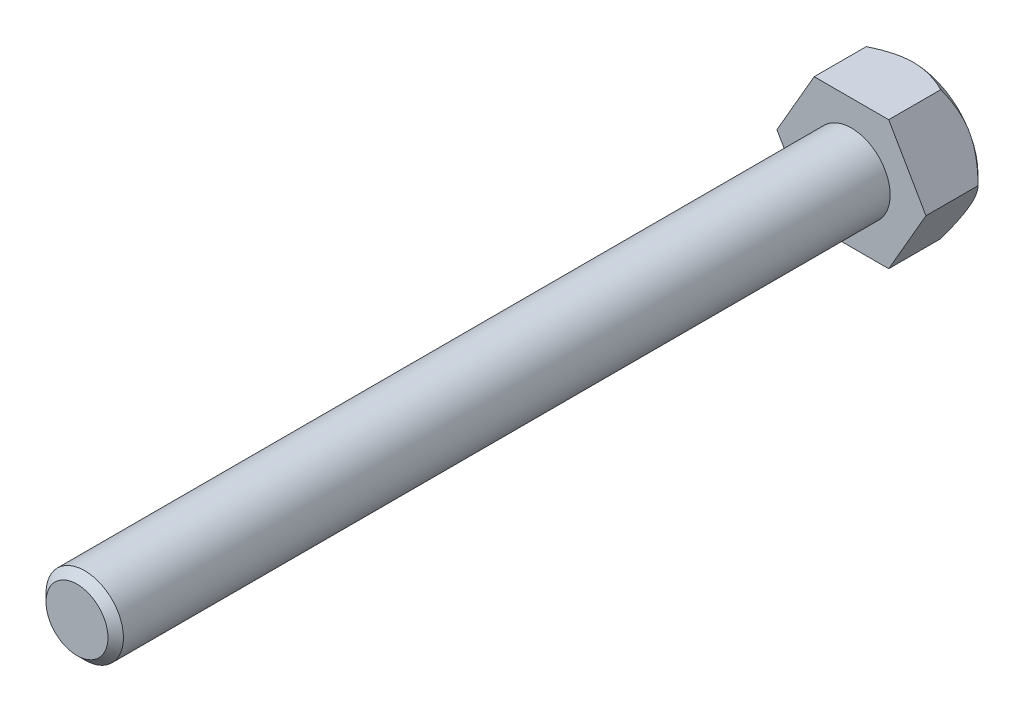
ISO-10303-21;
HEADER;
FILE_DESCRIPTION(('STEP AP214'),'2;1');
FILE_NAME('part.step','',(''),(''),'','','');
FILE_SCHEMA(('AUTOMOTIVE_DESIGN { 1 0 10303 214 1 1 1 1 }'));
ENDSEC;
DATA;
#1=APPLICATION_CONTEXT('core data for automotive mechanical design processes');
#2=APPLICATION_PROTOCOL_DEFINITION('international standard','automotive_design',2000,#1);
#3=PRODUCT_CONTEXT('',#1,'mechanical');
#4=PRODUCT('Part','Part','',(#3));
#5=PRODUCT_RELATED_PRODUCT_CATEGORY('part','',(#4));
#6=PRODUCT_DEFINITION_FORMATION('','',#4);
#7=PRODUCT_DEFINITION_CONTEXT('part definition',#1,'design');
#8=PRODUCT_DEFINITION('design','',#6,#7);
#9=PRODUCT_DEFINITION_SHAPE('','',#8);
#10=(LENGTH_UNIT() NAMED_UNIT(*) SI_UNIT(.MILLI.,.METRE.));
#11=(NAMED_UNIT(*) PLANE_ANGLE_UNIT() SI_UNIT($,.RADIAN.));
#12=(NAMED_UNIT(*) SI_UNIT($,.STERADIAN.) SOLID_ANGLE_UNIT());
#13=UNCERTAINTY_MEASURE_WITH_UNIT(LENGTH_MEASURE(1.E-05),#10,'distance_accuracy_value','');
#14=(GEOMETRIC_REPRESENTATION_CONTEXT(3) GLOBAL_UNCERTAINTY_ASSIGNED_CONTEXT((#13)) GLOBAL_UNIT_ASSIGNED_CONTEXT((#10,
#11,#12)) REPRESENTATION_CONTEXT('',''));
#15=CARTESIAN_POINT('',(0.,0.,0.));
#16=DIRECTION('',(0.,0.,1.));
#17=DIRECTION('',(1.,0.,0.));
#18=AXIS2_PLACEMENT_3D('',#15,#16,#17);
#19=CARTESIAN_POINT('',(2.88675134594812,-5.00000000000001,4.8));
#20=DIRECTION('',(-0.866025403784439,0.5,0.));
#21=DIRECTION('',(-0.5,-0.866025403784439,0.));
#22=AXIS2_PLACEMENT_3D('',#19,#20,#21);
#23=PLANE('',#22);
#24=CARTESIAN_POINT('',(7.79129155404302,3.49491282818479,3.53496924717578));
#25=CARTESIAN_POINT('',(7.72292052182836,3.37649072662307,3.4241323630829));
#26=CARTESIAN_POINT('',(7.65427873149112,3.25759965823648,3.31395752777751));
#27=CARTESIAN_POINT('',(7.51635994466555,3.01871731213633,3.09518520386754));
#28=CARTESIAN_POINT('',(7.44708289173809,2.89872593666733,2.98658785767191));
#29=CARTESIAN_POINT('',(7.3076482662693,2.65721808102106,2.77099037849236));
#30=CARTESIAN_POINT('',(7.23748900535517,2.53569867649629,2.66399460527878));
#31=CARTESIAN_POINT('',(7.09634434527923,2.29122895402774,2.45220977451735));
#32=CARTESIAN_POINT('',(7.02535896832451,2.16827867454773,2.34742065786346));
#33=CARTESIAN_POINT('',(6.88046665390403,1.91731782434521,2.1376229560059));
#34=CARTESIAN_POINT('',(6.80653308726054,1.7892611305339,2.03268775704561));
#35=CARTESIAN_POINT('',(6.65750074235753,1.53112953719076,1.82618348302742));
#36=CARTESIAN_POINT('',(6.58240200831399,1.40105471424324,1.72461428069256));
#37=CARTESIAN_POINT('',(6.43091343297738,1.13866880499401,1.52567192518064));
#38=CARTESIAN_POINT('',(6.35452473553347,1.00635969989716,1.42829530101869));
#39=CARTESIAN_POINT('',(6.20019211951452,0.739047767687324,1.23862386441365));
#40=CARTESIAN_POINT('',(6.12224839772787,0.604045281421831,1.14632841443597));
#41=CARTESIAN_POINT('',(5.96243636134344,0.32724271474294,0.965643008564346));
#42=CARTESIAN_POINT('',(5.88051890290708,0.185357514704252,0.87742575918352));
#43=CARTESIAN_POINT('',(5.7145278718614,-0.102147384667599,0.709375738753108));
#44=CARTESIAN_POINT('',(5.63045399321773,-0.247767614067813,0.629544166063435));
#45=CARTESIAN_POINT('',(5.46042282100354,-0.542270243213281,0.480891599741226));
#46=CARTESIAN_POINT('',(5.37447812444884,-0.691130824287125,0.412013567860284));
#47=CARTESIAN_POINT('',(5.20022530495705,-0.992945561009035,0.287405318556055));
#48=CARTESIAN_POINT('',(5.11191790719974,-1.14589846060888,0.231671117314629));
#49=CARTESIAN_POINT('',(4.95070027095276,-1.42513559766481,0.145609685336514));
#50=CARTESIAN_POINT('',(4.8781711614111,-1.55075970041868,0.112442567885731));
#51=CARTESIAN_POINT('',(4.732007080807,-1.80392331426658,0.0578850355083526));
#52=CARTESIAN_POINT('',(4.65837227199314,-1.93146254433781,0.0364929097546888));
#53=CARTESIAN_POINT('',(4.51057504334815,-2.18745485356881,0.00658377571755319));
#54=CARTESIAN_POINT('',(4.43641379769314,-2.31590589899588,-0.00195611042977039));
#55=CARTESIAN_POINT('',(4.28800384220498,-2.57295948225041,-0.00576437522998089));
#56=CARTESIAN_POINT('',(4.21375513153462,-2.70156202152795,-0.001032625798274));
#57=CARTESIAN_POINT('',(4.06595139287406,-2.95756560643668,0.021410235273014));
#58=CARTESIAN_POINT('',(3.99239506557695,-3.08496890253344,0.0390876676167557));
#59=CARTESIAN_POINT('',(3.84625439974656,-3.33809196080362,0.0864760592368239));
#60=CARTESIAN_POINT('',(3.77367029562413,-3.46381131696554,0.11618986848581));
#61=CARTESIAN_POINT('',(3.62960941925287,-3.71333207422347,0.186422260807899));
#62=CARTESIAN_POINT('',(3.55813655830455,-3.83712670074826,0.226972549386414));
#63=CARTESIAN_POINT('',(3.41669121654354,-4.08211721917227,0.317333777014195));
#64=CARTESIAN_POINT('',(3.3467186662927,-4.2033132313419,0.367144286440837));
#65=CARTESIAN_POINT('',(3.18386948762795,-4.4853762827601,0.493528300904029));
#66=CARTESIAN_POINT('',(3.09162422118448,-4.64514977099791,0.573343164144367));
#67=CARTESIAN_POINT('',(2.90973634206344,-4.96018881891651,0.744138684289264));
#68=CARTESIAN_POINT('',(2.82009513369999,-5.11545194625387,0.835125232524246));
#69=CARTESIAN_POINT('',(2.64297811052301,-5.42222762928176,1.02595012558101));
#70=CARTESIAN_POINT('',(2.55550717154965,-5.57373173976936,1.12580643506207));
#71=CARTESIAN_POINT('',(2.38261917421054,-5.87318253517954,1.33228271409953));
#72=CARTESIAN_POINT('',(2.29720175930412,-6.02112983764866,1.43890149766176));
#73=CARTESIAN_POINT('',(2.12770860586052,-6.31470059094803,1.65799413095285));
#74=CARTESIAN_POINT('',(2.0436409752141,-6.46030999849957,1.77049295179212));
#75=CARTESIAN_POINT('',(1.87698761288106,-6.74896208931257,1.99979470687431));
#76=CARTESIAN_POINT('',(1.79440193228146,-6.89200468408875,2.11659778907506));
#77=CARTESIAN_POINT('',(1.6305761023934,-7.17575934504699,2.35354819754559));
#78=CARTESIAN_POINT('',(1.549334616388,-7.31647372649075,2.47369183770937));
#79=CARTESIAN_POINT('',(1.38791735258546,-7.5960566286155,2.71681069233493));
#80=CARTESIAN_POINT('',(1.30774159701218,-7.73492511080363,2.83978596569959));
#81=CARTESIAN_POINT('',(1.16756053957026,-7.97772582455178,3.05808196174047));
#82=CARTESIAN_POINT('',(1.10736156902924,-8.08199350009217,3.15290655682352));
#83=CARTESIAN_POINT('',(0.987695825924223,-8.28926064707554,3.34331337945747));
#84=CARTESIAN_POINT('',(0.928226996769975,-8.39226368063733,3.43889043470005));
#85=CARTESIAN_POINT('',(0.868962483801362,-8.49491282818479,3.53496924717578));
#86=B_SPLINE_CURVE_WITH_KNOTS('',3,(#24,#25,#26,#27,#28,#29,#30,#31,#32,#33,#34,#35,#36,#37,#38,
#39,#40,#41,#42,#43,#44,#45,#46,#47,#48,#49,#50,#51,#52,#53,#54,#55,#56,#57,#58,#59,#60,#61,#62,
#63,#64,#65,#66,#67,#68,#69,#70,#71,#72,#73,#74,#75,#76,#77,#78,#79,#80,#81,#82,#83,#84,#85),
.UNSPECIFIED.,.F.,.F.,(4,2,2,2,2,2,2,2,2,2,2,2,2,2,2,2,2,2,2,2,2,2,2,2,2,2,2,2,2,2,4),(0.,
0.528064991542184,1.05617736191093,1.58553244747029,2.11487333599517,2.65878778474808,
3.20268164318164,3.74611620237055,4.28948242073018,4.84751798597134,5.40563318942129,
5.96073957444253,6.51567749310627,6.96165860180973,7.4075748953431,7.85269648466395,
8.29782236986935,8.74179431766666,9.18587145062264,9.63126237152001,10.0766326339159,
10.6791730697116,11.2820326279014,11.8861423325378,12.4901463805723,13.0969653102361,
13.7038051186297,14.309999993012,14.9162074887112,15.3759680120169,15.8337047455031),.UNSPECIFIED.);
#87=CARTESIAN_POINT('',(5.77350269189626,0.,0.769230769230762));
#88=VERTEX_POINT('',#87);
#89=CARTESIAN_POINT('',(4.43349224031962,-2.32096618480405,0.));
#90=VERTEX_POINT('',#89);
#91=EDGE_CURVE('E194',#88,#90,#86,.T.);
#92=ORIENTED_EDGE('',*,*,#91,.F.);
#93=DIRECTION('',(0.,0.,-1.));
#94=VECTOR('',#93,1.);
#95=CARTESIAN_POINT('',(5.77350269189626,0.,4.8));
#96=LINE('',#95,#94);
#97=CARTESIAN_POINT('',(5.77350269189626,0.,4.8));
#98=VERTEX_POINT('',#97);
#99=EDGE_CURVE('E161',#98,#88,#96,.T.);
#100=ORIENTED_EDGE('',*,*,#99,.F.);
#101=DIRECTION('',(0.5,0.866025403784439,0.));
#102=VECTOR('',#101,1.);
#103=CARTESIAN_POINT('',(2.88675134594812,-5.00000000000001,4.8));
#104=LINE('',#103,#102);
#105=CARTESIAN_POINT('',(2.88675134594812,-5.00000000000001,4.8));
#106=VERTEX_POINT('',#105);
#107=EDGE_CURVE('E216',#106,#98,#104,.T.);
#108=ORIENTED_EDGE('',*,*,#107,.F.);
#109=DIRECTION('',(0.,0.,-1.));
#110=VECTOR('',#109,1.);
#111=CARTESIAN_POINT('',(2.88675134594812,-5.00000000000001,4.8));
#112=LINE('',#111,#110);
#113=CARTESIAN_POINT('',(2.88675134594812,-5.00000000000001,0.769230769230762));
#114=VERTEX_POINT('',#113);
#115=EDGE_CURVE('E155',#106,#114,#112,.T.);
#116=ORIENTED_EDGE('',*,*,#115,.T.);
#117=CARTESIAN_POINT('',(4.22676179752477,-2.67903381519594,0.));
#118=VERTEX_POINT('',#117);
#119=EDGE_CURVE('E129',#118,#114,#86,.T.);
#120=ORIENTED_EDGE('',*,*,#119,.F.);
#121=DIRECTION('',(0.5,0.866025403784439,0.));
#122=VECTOR('',#121,1.);
#123=CARTESIAN_POINT('',(2.88675134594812,-5.00000000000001,0.));
#124=LINE('',#123,#122);
#125=EDGE_CURVE('E190',#118,#90,#124,.T.);
#126=ORIENTED_EDGE('',*,*,#125,.T.);
#127=EDGE_LOOP('',(#92,#100,#108,#116,#120,#126));
#128=FACE_BOUND('',#127,.T.);
#129=ADVANCED_FACE('F31',(#128),#23,.F.);
#130=CARTESIAN_POINT('',(5.77350269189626,0.,4.8));
#131=DIRECTION('',(-0.866025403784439,-0.5,0.));
#132=DIRECTION('',(0.5,-0.866025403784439,0.));
#133=AXIS2_PLACEMENT_3D('',#130,#131,#132);
#134=PLANE('',#133);
#135=CARTESIAN_POINT('',(0.868962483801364,8.49491282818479,3.53496924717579));
#136=CARTESIAN_POINT('',(0.937333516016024,8.37649072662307,3.42413236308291));
#137=CARTESIAN_POINT('',(1.00597530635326,8.25759965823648,3.31395752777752));
#138=CARTESIAN_POINT('',(1.14389409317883,8.01871731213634,3.09518520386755));
#139=CARTESIAN_POINT('',(1.2131711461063,7.89872593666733,2.98658785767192));
#140=CARTESIAN_POINT('',(1.35260577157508,7.65721808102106,2.77099037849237));
#141=CARTESIAN_POINT('',(1.42276503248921,7.5356986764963,2.66399460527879));
#142=CARTESIAN_POINT('',(1.56390969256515,7.29122895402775,2.45220977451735));
#143=CARTESIAN_POINT('',(1.63489506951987,7.16827867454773,2.34742065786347));
#144=CARTESIAN_POINT('',(1.77978738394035,6.91731782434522,2.13762295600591));
#145=CARTESIAN_POINT('',(1.85372095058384,6.78926113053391,2.03268775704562));
#146=CARTESIAN_POINT('',(2.00275329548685,6.53112953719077,1.82618348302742));
#147=CARTESIAN_POINT('',(2.0778520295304,6.40105471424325,1.72461428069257));
#148=CARTESIAN_POINT('',(2.22934060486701,6.13866880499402,1.52567192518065));
#149=CARTESIAN_POINT('',(2.30572930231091,6.00635969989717,1.42829530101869));
#150=CARTESIAN_POINT('',(2.46006191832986,5.73904776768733,1.23862386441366));
#151=CARTESIAN_POINT('',(2.53800564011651,5.60404528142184,1.14632841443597));
#152=CARTESIAN_POINT('',(2.69781767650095,5.32724271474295,0.965643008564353));
#153=CARTESIAN_POINT('',(2.77973513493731,5.18535751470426,0.877425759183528));
#154=CARTESIAN_POINT('',(2.94572616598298,4.89785261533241,0.709375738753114));
#155=CARTESIAN_POINT('',(3.02980004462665,4.75223238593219,0.629544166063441));
#156=CARTESIAN_POINT('',(3.19983121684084,4.45772975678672,0.48089159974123));
#157=CARTESIAN_POINT('',(3.28577591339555,4.30886917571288,0.412013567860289));
#158=CARTESIAN_POINT('',(3.46002873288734,4.00705443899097,0.287405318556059));
#159=CARTESIAN_POINT('',(3.54833613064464,3.85410153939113,0.231671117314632));
#160=CARTESIAN_POINT('',(3.70955376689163,3.57486440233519,0.145609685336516));
#161=CARTESIAN_POINT('',(3.78208287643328,3.44924029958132,0.112442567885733));
#162=CARTESIAN_POINT('',(3.92824695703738,3.19607668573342,0.0578850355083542));
#163=CARTESIAN_POINT('',(4.00188176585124,3.06853745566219,0.0364929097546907));
#164=CARTESIAN_POINT('',(4.14967899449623,2.81254514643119,0.00658377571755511));
#165=CARTESIAN_POINT('',(4.22384024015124,2.68409410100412,-0.00195611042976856));
#166=CARTESIAN_POINT('',(4.3722501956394,2.42704051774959,-0.00576437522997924));
#167=CARTESIAN_POINT('',(4.44649890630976,2.29843797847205,-0.00103262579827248));
#168=CARTESIAN_POINT('',(4.59430264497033,2.04243439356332,0.0214102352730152));
#169=CARTESIAN_POINT('',(4.66785897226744,1.91503109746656,0.0390876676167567));
#170=CARTESIAN_POINT('',(4.81399963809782,1.66190803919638,0.0864760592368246));
#171=CARTESIAN_POINT('',(4.88658374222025,1.53618868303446,0.11618986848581));
#172=CARTESIAN_POINT('',(5.03064461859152,1.28666792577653,0.1864222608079));
#173=CARTESIAN_POINT('',(5.10211747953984,1.16287329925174,0.226972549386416));
#174=CARTESIAN_POINT('',(5.24356282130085,0.917882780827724,0.317333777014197));
#175=CARTESIAN_POINT('',(5.31353537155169,0.796686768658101,0.367144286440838));
#176=CARTESIAN_POINT('',(5.47638455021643,0.514623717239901,0.493528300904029));
#177=CARTESIAN_POINT('',(5.5686298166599,0.354850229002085,0.573343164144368));
#178=CARTESIAN_POINT('',(5.75051769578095,0.0398111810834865,0.744138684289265));
#179=CARTESIAN_POINT('',(5.8401589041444,-0.115451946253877,0.835125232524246));
#180=CARTESIAN_POINT('',(6.01727592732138,-0.422227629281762,1.02595012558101));
#181=CARTESIAN_POINT('',(6.10474686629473,-0.573731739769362,1.12580643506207));
#182=CARTESIAN_POINT('',(6.27763486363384,-0.87318253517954,1.33228271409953));
#183=CARTESIAN_POINT('',(6.36305227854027,-1.02112983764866,1.43890149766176));
#184=CARTESIAN_POINT('',(6.53254543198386,-1.31470059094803,1.65799413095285));
#185=CARTESIAN_POINT('',(6.61661306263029,-1.46030999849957,1.77049295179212));
#186=CARTESIAN_POINT('',(6.78326642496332,-1.74896208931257,1.99979470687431));
#187=CARTESIAN_POINT('',(6.86585210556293,-1.89200468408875,2.11659778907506));
#188=CARTESIAN_POINT('',(7.02967793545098,-2.17575934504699,2.35354819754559));
#189=CARTESIAN_POINT('',(7.11091942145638,-2.31647372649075,2.47369183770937));
#190=CARTESIAN_POINT('',(7.27233668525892,-2.5960566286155,2.71681069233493));
#191=CARTESIAN_POINT('',(7.3525124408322,-2.73492511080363,2.83978596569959));
#192=CARTESIAN_POINT('',(7.49269349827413,-2.97772582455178,3.05808196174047));
#193=CARTESIAN_POINT('',(7.55289246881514,-3.08199350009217,3.15290655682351));
#194=CARTESIAN_POINT('',(7.67255821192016,-3.28926064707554,3.34331337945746));
#195=CARTESIAN_POINT('',(7.7320270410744,-3.39226368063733,3.43889043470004));
#196=CARTESIAN_POINT('',(7.79129155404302,-3.49491282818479,3.53496924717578));
#197=B_SPLINE_CURVE_WITH_KNOTS('',3,(#135,#136,#137,#138,#139,#140,#141,#142,#143,#144,#145,
#146,#147,#148,#149,#150,#151,#152,#153,#154,#155,#156,#157,#158,#159,#160,#161,#162,#163,#164,
#165,#166,#167,#168,#169,#170,#171,#172,#173,#174,#175,#176,#177,#178,#179,#180,#181,#182,#183,
#184,#185,#186,#187,#188,#189,#190,#191,#192,#193,#194,#195,#196),.UNSPECIFIED.,.F.,.F.,(4,2,2,
2,2,2,2,2,2,2,2,2,2,2,2,2,2,2,2,2,2,2,2,2,2,2,2,2,2,2,4),(0.,0.528064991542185,1.05617736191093,
1.58553244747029,2.11487333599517,2.65878778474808,3.20268164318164,3.74611620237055,
4.28948242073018,4.84751798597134,5.40563318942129,5.96073957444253,6.51567749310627,
6.96165860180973,7.4075748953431,7.85269648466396,8.29782236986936,8.74179431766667,
9.18587145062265,9.63126237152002,10.0766326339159,10.6791730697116,11.2820326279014,
11.8861423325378,12.4901463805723,13.0969653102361,13.7038051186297,14.309999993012,
14.9162074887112,15.3759680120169,15.8337047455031),.UNSPECIFIED.);
#198=CARTESIAN_POINT('',(2.88675134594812,5.00000000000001,0.769230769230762));
#199=VERTEX_POINT('',#198);
#200=CARTESIAN_POINT('',(4.22676179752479,2.67903381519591,0.));
#201=VERTEX_POINT('',#200);
#202=EDGE_CURVE('E46',#199,#201,#197,.T.);
#203=ORIENTED_EDGE('',*,*,#202,.F.);
#204=DIRECTION('',(0.,0.,-1.));
#205=VECTOR('',#204,1.);
#206=CARTESIAN_POINT('',(2.88675134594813,5.00000000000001,4.8));
#207=LINE('',#206,#205);
#208=CARTESIAN_POINT('',(2.88675134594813,5.00000000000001,4.8));
#209=VERTEX_POINT('',#208);
#210=EDGE_CURVE('E152',#209,#199,#207,.T.);
#211=ORIENTED_EDGE('',*,*,#210,.F.);
#212=DIRECTION('',(-0.5,0.866025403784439,0.));
#213=VECTOR('',#212,1.);
#214=CARTESIAN_POINT('',(5.77350269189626,0.,4.8));
#215=LINE('',#214,#213);
#216=EDGE_CURVE('E225',#98,#209,#215,.T.);
#217=ORIENTED_EDGE('',*,*,#216,.F.);
#218=ORIENTED_EDGE('',*,*,#99,.T.);
#219=CARTESIAN_POINT('',(4.4334922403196,2.32096618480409,0.));
#220=VERTEX_POINT('',#219);
#221=EDGE_CURVE('E234',#220,#88,#197,.T.);
#222=ORIENTED_EDGE('',*,*,#221,.F.);
#223=DIRECTION('',(-0.5,0.866025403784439,0.));
#224=VECTOR('',#223,1.);
#225=CARTESIAN_POINT('',(5.77350269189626,0.,0.));
#226=LINE('',#225,#224);
#227=EDGE_CURVE('E198',#220,#201,#226,.T.);
#228=ORIENTED_EDGE('',*,*,#227,.T.);
#229=EDGE_LOOP('',(#203,#211,#217,#218,#222,#228));
#230=FACE_BOUND('',#229,.T.);
#231=ADVANCED_FACE('F240',(#230),#134,.F.);
#232=CARTESIAN_POINT('',(2.88675134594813,5.00000000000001,4.8));
#233=DIRECTION('',(0.,-1.,0.));
#234=DIRECTION('',(1.,0.,0.));
#235=AXIS2_PLACEMENT_3D('',#232,#233,#234);
#236=PLANE('',#235);
#237=CARTESIAN_POINT('',(-6.38166417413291,5.00000000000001,3.10286306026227));
#238=CARTESIAN_POINT('',(-6.23878902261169,5.00000000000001,2.99041641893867));
#239=CARTESIAN_POINT('',(-6.09522899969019,5.00000000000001,2.8788288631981));
#240=CARTESIAN_POINT('',(-5.80647450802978,5.00000000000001,2.65774055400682));
#241=CARTESIAN_POINT('',(-5.6612797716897,5.00000000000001,2.54824015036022));
#242=CARTESIAN_POINT('',(-5.36830447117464,5.00000000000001,2.3311886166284));
#243=CARTESIAN_POINT('',(-5.22051458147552,5.00000000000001,2.2236500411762));
#244=CARTESIAN_POINT('',(-4.92277103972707,5.00000000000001,2.011620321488));
#245=CARTESIAN_POINT('',(-4.77281749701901,5.00000000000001,1.90712902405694));
#246=CARTESIAN_POINT('',(-4.46292134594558,5.00000000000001,1.6967788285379));
#247=CARTESIAN_POINT('',(-4.30285113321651,5.00000000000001,1.59110720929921));
#248=CARTESIAN_POINT('',(-3.97947745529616,5.00000000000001,1.38483841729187));
#249=CARTESIAN_POINT('',(-3.81617425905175,5.00000000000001,1.28424082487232));
#250=CARTESIAN_POINT('',(-3.48610120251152,5.00000000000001,1.089590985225));
#251=CARTESIAN_POINT('',(-3.31933837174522,5.00000000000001,0.99552688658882));
#252=CARTESIAN_POINT('',(-2.98154550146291,5.00000000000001,0.81545284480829));
#253=CARTESIAN_POINT('',(-2.81051677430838,5.00000000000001,0.72944046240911));
#254=CARTESIAN_POINT('',(-2.48154741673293,5.00000000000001,0.575975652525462));
#255=CARTESIAN_POINT('',(-2.32407640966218,5.00000000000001,0.507523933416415));
#256=CARTESIAN_POINT('',(-2.00503464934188,5.00000000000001,0.380775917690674));
#257=CARTESIAN_POINT('',(-1.84346350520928,5.00000000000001,0.322480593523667));
#258=CARTESIAN_POINT('',(-1.51818964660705,5.00000000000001,0.218890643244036));
#259=CARTESIAN_POINT('',(-1.35453252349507,5.00000000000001,0.17345479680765));
#260=CARTESIAN_POINT('',(-1.02386090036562,5.00000000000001,0.0969485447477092));
#261=CARTESIAN_POINT('',(-0.856846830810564,5.00000000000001,0.0658763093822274));
#262=CARTESIAN_POINT('',(-0.517413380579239,5.00000000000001,0.0195673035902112));
#263=CARTESIAN_POINT('',(-0.344951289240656,5.00000000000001,0.00463681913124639));
#264=CARTESIAN_POINT('',(0.000587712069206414,5.00000000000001,-0.00725310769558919));
#265=CARTESIAN_POINT('',(0.173664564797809,5.00000000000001,-0.00421418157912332));
#266=CARTESIAN_POINT('',(0.519083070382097,5.00000000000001,0.0196365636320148));
#267=CARTESIAN_POINT('',(0.691421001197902,5.00000000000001,0.0405012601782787));
#268=CARTESIAN_POINT('',(1.03329919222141,5.00000000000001,0.0985979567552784));
#269=CARTESIAN_POINT('',(1.20283868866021,5.00000000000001,0.135834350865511));
#270=CARTESIAN_POINT('',(1.5893915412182,5.00000000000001,0.238015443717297));
#271=CARTESIAN_POINT('',(1.80507481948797,5.00000000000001,0.307950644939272));
#272=CARTESIAN_POINT('',(2.22934965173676,5.00000000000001,0.466667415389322));
#273=CARTESIAN_POINT('',(2.43793689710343,5.00000000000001,0.555460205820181));
#274=CARTESIAN_POINT('',(2.84987873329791,5.00000000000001,0.747980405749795));
#275=CARTESIAN_POINT('',(3.05318359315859,5.00000000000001,0.851812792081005));
#276=CARTESIAN_POINT('',(3.45376565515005,5.00000000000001,1.07029248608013));
#277=CARTESIAN_POINT('',(3.65104423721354,5.00000000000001,1.18493729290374));
#278=CARTESIAN_POINT('',(4.06969479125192,5.00000000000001,1.44017519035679));
#279=CARTESIAN_POINT('',(4.29025868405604,5.00000000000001,1.58208501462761));
#280=CARTESIAN_POINT('',(4.72605150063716,5.00000000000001,1.87391158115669));
#281=CARTESIAN_POINT('',(4.9412791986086,5.00000000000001,2.02383013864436));
#282=CARTESIAN_POINT('',(5.36261277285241,5.00000000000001,2.32625331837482));
#283=CARTESIAN_POINT('',(5.56881495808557,5.00000000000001,2.47862431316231));
#284=CARTESIAN_POINT('',(5.87550903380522,5.00000000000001,2.71046405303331));
#285=CARTESIAN_POINT('',(5.97727048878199,5.,2.78826346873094));
#286=CARTESIAN_POINT('',(6.18002372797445,5.,2.9448508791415));
#287=CARTESIAN_POINT('',(6.28101554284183,5.,3.02363883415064));
#288=CARTESIAN_POINT('',(6.38166417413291,5.,3.10286306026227));
#289=B_SPLINE_CURVE_WITH_KNOTS('',3,(#237,#238,#239,#240,#241,#242,#243,#244,#245,#246,#247,
#248,#249,#250,#251,#252,#253,#254,#255,#256,#257,#258,#259,#260,#261,#262,#263,#264,#265,#266,
#267,#268,#269,#270,#271,#272,#273,#274,#275,#276,#277,#278,#279,#280,#281,#282,#283,#284,#285,
#286,#287,#288),.UNSPECIFIED.,.F.,.F.,(4,2,2,2,2,2,2,2,2,2,2,2,2,2,2,2,2,2,2,2,2,2,2,2,2,4),(0.,
0.545459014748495,1.09100865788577,1.63929871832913,2.18756116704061,2.76289810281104,
3.33818737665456,3.91240427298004,4.48644664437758,5.00127840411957,5.51615943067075,
6.02514484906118,6.53406541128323,7.05248174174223,7.57085100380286,8.09076329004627,
8.61081520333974,9.28983725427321,9.96926449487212,10.6536857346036,11.3379490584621,
12.1245257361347,12.9112814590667,13.6803735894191,14.0646517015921,14.4489144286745),.UNSPECIFIED.);
#290=CARTESIAN_POINT('',(-2.88675134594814,4.99999999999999,0.769230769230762));
#291=VERTEX_POINT('',#290);
#292=CARTESIAN_POINT('',(-0.206730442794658,5.00000000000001,0.));
#293=VERTEX_POINT('',#292);
#294=EDGE_CURVE('E54',#291,#293,#289,.T.);
#295=ORIENTED_EDGE('',*,*,#294,.F.);
#296=DIRECTION('',(0.,0.,-1.));
#297=VECTOR('',#296,1.);
#298=CARTESIAN_POINT('',(-2.88675134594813,5.00000000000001,4.8));
#299=LINE('',#298,#297);
#300=CARTESIAN_POINT('',(-2.88675134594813,5.00000000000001,4.8));
#301=VERTEX_POINT('',#300);
#302=EDGE_CURVE('E148',#301,#291,#299,.T.);
#303=ORIENTED_EDGE('',*,*,#302,.F.);
#304=DIRECTION('',(-1.,0.,0.));
#305=VECTOR('',#304,1.);
#306=CARTESIAN_POINT('',(2.88675134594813,5.00000000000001,4.8));
#307=LINE('',#306,#305);
#308=EDGE_CURVE('E221',#209,#301,#307,.T.);
#309=ORIENTED_EDGE('',*,*,#308,.F.);
#310=ORIENTED_EDGE('',*,*,#210,.T.);
#311=CARTESIAN_POINT('',(0.20673044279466,5.00000000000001,0.));
#312=VERTEX_POINT('',#311);
#313=EDGE_CURVE('E235',#312,#199,#289,.T.);
#314=ORIENTED_EDGE('',*,*,#313,.F.);
#315=DIRECTION('',(-1.,0.,0.));
#316=VECTOR('',#315,1.);
#317=CARTESIAN_POINT('',(2.88675134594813,5.00000000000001,0.));
#318=LINE('',#317,#316);
#319=EDGE_CURVE('E202',#312,#293,#318,.T.);
#320=ORIENTED_EDGE('',*,*,#319,.T.);
#321=EDGE_LOOP('',(#295,#303,#309,#310,#314,#320));
#322=FACE_BOUND('',#321,.T.);
#323=ADVANCED_FACE('F275',(#322),#236,.F.);
#324=CARTESIAN_POINT('',(-2.88675134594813,5.00000000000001,4.8));
#325=DIRECTION('',(0.866025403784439,-0.5,0.));
#326=DIRECTION('',(0.5,0.866025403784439,0.));
#327=AXIS2_PLACEMENT_3D('',#324,#325,#326);
#328=PLANE('',#327);
#329=CARTESIAN_POINT('',(-7.79129155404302,-3.49491282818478,3.53496924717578));
#330=CARTESIAN_POINT('',(-7.72292052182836,-3.37649072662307,3.4241323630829));
#331=CARTESIAN_POINT('',(-7.65427873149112,-3.25759965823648,3.31395752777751));
#332=CARTESIAN_POINT('',(-7.51635994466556,-3.01871731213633,3.09518520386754));
#333=CARTESIAN_POINT('',(-7.44708289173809,-2.89872593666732,2.98658785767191));
#334=CARTESIAN_POINT('',(-7.30764826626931,-2.65721808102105,2.77099037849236));
#335=CARTESIAN_POINT('',(-7.23748900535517,-2.53569867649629,2.66399460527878));
#336=CARTESIAN_POINT('',(-7.09634434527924,-2.29122895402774,2.45220977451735));
#337=CARTESIAN_POINT('',(-7.02535896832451,-2.16827867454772,2.34742065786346));
#338=CARTESIAN_POINT('',(-6.88046665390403,-1.9173178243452,2.13762295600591));
#339=CARTESIAN_POINT('',(-6.80653308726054,-1.7892611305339,2.03268775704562));
#340=CARTESIAN_POINT('',(-6.65750074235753,-1.53112953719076,1.82618348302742));
#341=CARTESIAN_POINT('',(-6.58240200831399,-1.40105471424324,1.72461428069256));
#342=CARTESIAN_POINT('',(-6.43091343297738,-1.138668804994,1.52567192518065));
#343=CARTESIAN_POINT('',(-6.35452473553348,-1.00635969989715,1.42829530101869));
#344=CARTESIAN_POINT('',(-6.20019211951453,-0.739047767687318,1.23862386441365));
#345=CARTESIAN_POINT('',(-6.12224839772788,-0.604045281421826,1.14632841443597));
#346=CARTESIAN_POINT('',(-5.96243636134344,-0.327242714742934,0.965643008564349));
#347=CARTESIAN_POINT('',(-5.88051890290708,-0.185357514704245,0.877425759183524));
#348=CARTESIAN_POINT('',(-5.7145278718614,0.102147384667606,0.709375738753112));
#349=CARTESIAN_POINT('',(-5.63045399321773,0.247767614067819,0.629544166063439));
#350=CARTESIAN_POINT('',(-5.46042282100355,0.542270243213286,0.48089159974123));
#351=CARTESIAN_POINT('',(-5.37447812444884,0.691130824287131,0.412013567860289));
#352=CARTESIAN_POINT('',(-5.20022530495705,0.992945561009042,0.287405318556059));
#353=CARTESIAN_POINT('',(-5.11191790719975,1.14589846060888,0.231671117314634));
#354=CARTESIAN_POINT('',(-4.95070027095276,1.42513559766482,0.145609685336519));
#355=CARTESIAN_POINT('',(-4.87817116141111,1.55075970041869,0.112442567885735));
#356=CARTESIAN_POINT('',(-4.73200708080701,1.80392331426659,0.0578850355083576));
#357=CARTESIAN_POINT('',(-4.65837227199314,1.93146254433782,0.0364929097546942));
#358=CARTESIAN_POINT('',(-4.51057504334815,2.18745485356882,0.00658377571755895));
#359=CARTESIAN_POINT('',(-4.43641379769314,2.31590589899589,-0.00195611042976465));
#360=CARTESIAN_POINT('',(-4.28800384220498,2.57295948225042,-0.00576437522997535));
#361=CARTESIAN_POINT('',(-4.21375513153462,2.70156202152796,-0.00103262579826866));
#362=CARTESIAN_POINT('',(-4.06595139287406,2.95756560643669,0.0214102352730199));
#363=CARTESIAN_POINT('',(-3.99239506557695,3.08496890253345,0.0390876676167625));
#364=CARTESIAN_POINT('',(-3.84625439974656,3.33809196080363,0.0864760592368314));
#365=CARTESIAN_POINT('',(-3.77367029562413,3.46381131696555,0.116189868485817));
#366=CARTESIAN_POINT('',(-3.62960941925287,3.71333207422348,0.186422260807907));
#367=CARTESIAN_POINT('',(-3.55813655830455,3.83712670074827,0.226972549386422));
#368=CARTESIAN_POINT('',(-3.41669121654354,4.08211721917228,0.317333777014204));
#369=CARTESIAN_POINT('',(-3.3467186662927,4.20331323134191,0.367144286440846));
#370=CARTESIAN_POINT('',(-3.18386948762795,4.48537628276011,0.493528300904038));
#371=CARTESIAN_POINT('',(-3.09162422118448,4.64514977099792,0.573343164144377));
#372=CARTESIAN_POINT('',(-2.90973634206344,4.96018881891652,0.744138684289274));
#373=CARTESIAN_POINT('',(-2.82009513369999,5.11545194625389,0.835125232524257));
#374=CARTESIAN_POINT('',(-2.642978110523,5.42222762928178,1.02595012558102));
#375=CARTESIAN_POINT('',(-2.55550717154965,5.57373173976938,1.12580643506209));
#376=CARTESIAN_POINT('',(-2.38261917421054,5.87318253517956,1.33228271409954));
#377=CARTESIAN_POINT('',(-2.29720175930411,6.02112983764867,1.43890149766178));
#378=CARTESIAN_POINT('',(-2.12770860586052,6.31470059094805,1.65799413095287));
#379=CARTESIAN_POINT('',(-2.04364097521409,6.46030999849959,1.77049295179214));
#380=CARTESIAN_POINT('',(-1.87698761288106,6.74896208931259,1.99979470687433));
#381=CARTESIAN_POINT('',(-1.79440193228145,6.89200468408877,2.11659778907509));
#382=CARTESIAN_POINT('',(-1.6305761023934,7.17575934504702,2.35354819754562));
#383=CARTESIAN_POINT('',(-1.54933461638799,7.31647372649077,2.47369183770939));
#384=CARTESIAN_POINT('',(-1.38791735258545,7.59605662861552,2.71681069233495));
#385=CARTESIAN_POINT('',(-1.30774159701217,7.73492511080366,2.83978596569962));
#386=CARTESIAN_POINT('',(-1.16756053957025,7.9777258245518,3.05808196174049));
#387=CARTESIAN_POINT('',(-1.10736156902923,8.08199350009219,3.15290655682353));
#388=CARTESIAN_POINT('',(-0.987695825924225,8.28926064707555,3.34331337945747));
#389=CARTESIAN_POINT('',(-0.928226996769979,8.39226368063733,3.43889043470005));
#390=CARTESIAN_POINT('',(-0.868962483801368,8.49491282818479,3.53496924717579));
#391=B_SPLINE_CURVE_WITH_KNOTS('',3,(#329,#330,#331,#332,#333,#334,#335,#336,#337,#338,#339,
#340,#341,#342,#343,#344,#345,#346,#347,#348,#349,#350,#351,#352,#353,#354,#355,#356,#357,#358,
#359,#360,#361,#362,#363,#364,#365,#366,#367,#368,#369,#370,#371,#372,#373,#374,#375,#376,#377,
#378,#379,#380,#381,#382,#383,#384,#385,#386,#387,#388,#389,#390),.UNSPECIFIED.,.F.,.F.,(4,2,2,
2,2,2,2,2,2,2,2,2,2,2,2,2,2,2,2,2,2,2,2,2,2,2,2,2,2,2,4),(0.,0.528064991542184,1.05617736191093,
1.58553244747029,2.11487333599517,2.65878778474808,3.20268164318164,3.74611620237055,
4.28948242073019,4.84751798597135,5.40563318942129,5.96073957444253,6.51567749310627,
6.96165860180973,7.4075748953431,7.85269648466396,8.29782236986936,8.74179431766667,
9.18587145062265,9.63126237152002,10.0766326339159,10.6791730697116,11.2820326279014,
11.8861423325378,12.4901463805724,13.0969653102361,13.7038051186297,14.309999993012,
14.9162074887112,15.3759680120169,15.8337047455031),.UNSPECIFIED.);
#392=CARTESIAN_POINT('',(-5.77350269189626,0.,0.769230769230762));
#393=VERTEX_POINT('',#392);
#394=CARTESIAN_POINT('',(-4.43349224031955,2.32096618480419,0.));
#395=VERTEX_POINT('',#394);
#396=EDGE_CURVE('E122',#393,#395,#391,.T.);
#397=ORIENTED_EDGE('',*,*,#396,.F.);
#398=DIRECTION('',(0.,0.,-1.));
#399=VECTOR('',#398,1.);
#400=CARTESIAN_POINT('',(-5.77350269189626,0.,4.8));
#401=LINE('',#400,#399);
#402=CARTESIAN_POINT('',(-5.77350269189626,0.,4.8));
#403=VERTEX_POINT('',#402);
#404=EDGE_CURVE('E137',#403,#393,#401,.T.);
#405=ORIENTED_EDGE('',*,*,#404,.F.);
#406=DIRECTION('',(-0.5,-0.866025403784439,0.));
#407=VECTOR('',#406,1.);
#408=CARTESIAN_POINT('',(-2.88675134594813,5.00000000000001,4.8));
#409=LINE('',#408,#407);
#410=EDGE_CURVE('E220',#301,#403,#409,.T.);
#411=ORIENTED_EDGE('',*,*,#410,.F.);
#412=ORIENTED_EDGE('',*,*,#302,.T.);
#413=CARTESIAN_POINT('',(-4.22676179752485,2.67903381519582,0.));
#414=VERTEX_POINT('',#413);
#415=EDGE_CURVE('E142',#414,#291,#391,.T.);
#416=ORIENTED_EDGE('',*,*,#415,.F.);
#417=DIRECTION('',(-0.5,-0.866025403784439,0.));
#418=VECTOR('',#417,1.);
#419=CARTESIAN_POINT('',(-2.88675134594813,5.00000000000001,0.));
#420=LINE('',#419,#418);
#421=EDGE_CURVE('E141',#414,#395,#420,.T.);
#422=ORIENTED_EDGE('',*,*,#421,.T.);
#423=EDGE_LOOP('',(#397,#405,#411,#412,#416,#422));
#424=FACE_BOUND('',#423,.T.);
#425=ADVANCED_FACE('F135',(#424),#328,.F.);
#426=CARTESIAN_POINT('',(-5.77350269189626,0.,4.8));
#427=DIRECTION('',(0.866025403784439,0.5,0.));
#428=DIRECTION('',(-0.5,0.866025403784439,0.));
#429=AXIS2_PLACEMENT_3D('',#426,#427,#428);
#430=PLANE('',#429);
#431=CARTESIAN_POINT('',(-0.86896248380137,-8.49491282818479,3.53496924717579));
#432=CARTESIAN_POINT('',(-0.93733351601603,-8.37649072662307,3.42413236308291));
#433=CARTESIAN_POINT('',(-1.00597530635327,-8.25759965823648,3.31395752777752));
#434=CARTESIAN_POINT('',(-1.14389409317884,-8.01871731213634,3.09518520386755));
#435=CARTESIAN_POINT('',(-1.2131711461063,-7.89872593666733,2.98658785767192));
#436=CARTESIAN_POINT('',(-1.35260577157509,-7.65721808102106,2.77099037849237));
#437=CARTESIAN_POINT('',(-1.42276503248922,-7.5356986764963,2.66399460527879));
#438=CARTESIAN_POINT('',(-1.56390969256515,-7.29122895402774,2.45220977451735));
#439=CARTESIAN_POINT('',(-1.63489506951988,-7.16827867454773,2.34742065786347));
#440=CARTESIAN_POINT('',(-1.77978738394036,-6.91731782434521,2.13762295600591));
#441=CARTESIAN_POINT('',(-1.85372095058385,-6.7892611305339,2.03268775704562));
#442=CARTESIAN_POINT('',(-2.00275329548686,-6.53112953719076,1.82618348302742));
#443=CARTESIAN_POINT('',(-2.0778520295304,-6.40105471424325,1.72461428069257));
#444=CARTESIAN_POINT('',(-2.22934060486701,-6.13866880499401,1.52567192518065));
#445=CARTESIAN_POINT('',(-2.30572930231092,-6.00635969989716,1.42829530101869));
#446=CARTESIAN_POINT('',(-2.46006191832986,-5.73904776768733,1.23862386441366));
#447=CARTESIAN_POINT('',(-2.53800564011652,-5.60404528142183,1.14632841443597));
#448=CARTESIAN_POINT('',(-2.69781767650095,-5.32724271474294,0.965643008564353));
#449=CARTESIAN_POINT('',(-2.77973513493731,-5.18535751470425,0.877425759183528));
#450=CARTESIAN_POINT('',(-2.94572616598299,-4.8978526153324,0.709375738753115));
#451=CARTESIAN_POINT('',(-3.02980004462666,-4.75223238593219,0.629544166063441));
#452=CARTESIAN_POINT('',(-3.19983121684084,-4.45772975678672,0.480891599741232));
#453=CARTESIAN_POINT('',(-3.28577591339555,-4.30886917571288,0.412013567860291));
#454=CARTESIAN_POINT('',(-3.46002873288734,-4.00705443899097,0.287405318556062));
#455=CARTESIAN_POINT('',(-3.54833613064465,-3.85410153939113,0.231671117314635));
#456=CARTESIAN_POINT('',(-3.70955376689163,-3.57486440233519,0.145609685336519));
#457=CARTESIAN_POINT('',(-3.78208287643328,-3.44924029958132,0.112442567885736));
#458=CARTESIAN_POINT('',(-3.92824695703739,-3.19607668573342,0.0578850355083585));
#459=CARTESIAN_POINT('',(-4.00188176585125,-3.06853745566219,0.0364929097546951));
#460=CARTESIAN_POINT('',(-4.14967899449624,-2.81254514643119,0.00658377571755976));
#461=CARTESIAN_POINT('',(-4.22384024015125,-2.68409410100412,-0.00195611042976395));
#462=CARTESIAN_POINT('',(-4.37225019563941,-2.42704051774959,-0.00576437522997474));
#463=CARTESIAN_POINT('',(-4.44649890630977,-2.29843797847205,-0.00103262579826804));
#464=CARTESIAN_POINT('',(-4.59430264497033,-2.04243439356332,0.0214102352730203));
#465=CARTESIAN_POINT('',(-4.66785897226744,-1.91503109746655,0.0390876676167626));
#466=CARTESIAN_POINT('',(-4.81399963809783,-1.66190803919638,0.086476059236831));
#467=CARTESIAN_POINT('',(-4.88658374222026,-1.53618868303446,0.116189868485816));
#468=CARTESIAN_POINT('',(-5.03064461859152,-1.28666792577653,0.186422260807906));
#469=CARTESIAN_POINT('',(-5.10211747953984,-1.16287329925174,0.226972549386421));
#470=CARTESIAN_POINT('',(-5.24356282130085,-0.917882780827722,0.317333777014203));
#471=CARTESIAN_POINT('',(-5.3135353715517,-0.796686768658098,0.367144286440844));
#472=CARTESIAN_POINT('',(-5.47638455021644,-0.514623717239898,0.493528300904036));
#473=CARTESIAN_POINT('',(-5.56862981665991,-0.354850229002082,0.573343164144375));
#474=CARTESIAN_POINT('',(-5.75051769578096,-0.039811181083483,0.744138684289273));
#475=CARTESIAN_POINT('',(-5.84015890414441,0.115451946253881,0.835125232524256));
#476=CARTESIAN_POINT('',(-6.01727592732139,0.422227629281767,1.02595012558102));
#477=CARTESIAN_POINT('',(-6.10474686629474,0.573731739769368,1.12580643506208));
#478=CARTESIAN_POINT('',(-6.27763486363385,0.873182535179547,1.33228271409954));
#479=CARTESIAN_POINT('',(-6.36305227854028,1.02112983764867,1.43890149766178));
#480=CARTESIAN_POINT('',(-6.53254543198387,1.31470059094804,1.65799413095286));
#481=CARTESIAN_POINT('',(-6.6166130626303,1.46030999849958,1.77049295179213));
#482=CARTESIAN_POINT('',(-6.78326642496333,1.74896208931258,1.99979470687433));
#483=CARTESIAN_POINT('',(-6.86585210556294,1.89200468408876,2.11659778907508));
#484=CARTESIAN_POINT('',(-7.02967793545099,2.175759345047,2.35354819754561));
#485=CARTESIAN_POINT('',(-7.1109194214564,2.31647372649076,2.47369183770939));
#486=CARTESIAN_POINT('',(-7.27233668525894,2.59605662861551,2.71681069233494));
#487=CARTESIAN_POINT('',(-7.35251244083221,2.73492511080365,2.83978596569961));
#488=CARTESIAN_POINT('',(-7.49269349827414,2.97772582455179,3.05808196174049));
#489=CARTESIAN_POINT('',(-7.55289246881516,3.08199350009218,3.15290655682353));
#490=CARTESIAN_POINT('',(-7.67255821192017,3.28926064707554,3.34331337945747));
#491=CARTESIAN_POINT('',(-7.73202704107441,3.39226368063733,3.43889043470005));
#492=CARTESIAN_POINT('',(-7.79129155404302,3.49491282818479,3.53496924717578));
#493=B_SPLINE_CURVE_WITH_KNOTS('',3,(#431,#432,#433,#434,#435,#436,#437,#438,#439,#440,#441,
#442,#443,#444,#445,#446,#447,#448,#449,#450,#451,#452,#453,#454,#455,#456,#457,#458,#459,#460,
#461,#462,#463,#464,#465,#466,#467,#468,#469,#470,#471,#472,#473,#474,#475,#476,#477,#478,#479,
#480,#481,#482,#483,#484,#485,#486,#487,#488,#489,#490,#491,#492),.UNSPECIFIED.,.F.,.F.,(4,2,2,
2,2,2,2,2,2,2,2,2,2,2,2,2,2,2,2,2,2,2,2,2,2,2,2,2,2,2,4),(0.,0.528064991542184,1.05617736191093,
1.58553244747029,2.11487333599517,2.65878778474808,3.20268164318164,3.74611620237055,
4.28948242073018,4.84751798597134,5.40563318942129,5.96073957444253,6.51567749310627,
6.96165860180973,7.4075748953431,7.85269648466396,8.29782236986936,8.74179431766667,
9.18587145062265,9.63126237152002,10.0766326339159,10.6791730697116,11.2820326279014,
11.8861423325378,12.4901463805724,13.0969653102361,13.7038051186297,14.309999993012,
14.9162074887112,15.3759680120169,15.8337047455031),.UNSPECIFIED.);
#494=CARTESIAN_POINT('',(-2.88675134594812,-5.00000000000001,0.769230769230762));
#495=VERTEX_POINT('',#494);
#496=CARTESIAN_POINT('',(-4.22676179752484,-2.67903381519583,0.));
#497=VERTEX_POINT('',#496);
#498=EDGE_CURVE('E131',#495,#497,#493,.T.);
#499=ORIENTED_EDGE('',*,*,#498,.F.);
#500=DIRECTION('',(0.,0.,-1.));
#501=VECTOR('',#500,1.);
#502=CARTESIAN_POINT('',(-2.88675134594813,-5.,4.8));
#503=LINE('',#502,#501);
#504=CARTESIAN_POINT('',(-2.88675134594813,-5.,4.8));
#505=VERTEX_POINT('',#504);
#506=EDGE_CURVE('E149',#505,#495,#503,.T.);
#507=ORIENTED_EDGE('',*,*,#506,.F.);
#508=DIRECTION('',(0.5,-0.866025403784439,0.));
#509=VECTOR('',#508,1.);
#510=CARTESIAN_POINT('',(-5.77350269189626,0.,4.8));
#511=LINE('',#510,#509);
#512=EDGE_CURVE('E147',#403,#505,#511,.T.);
#513=ORIENTED_EDGE('',*,*,#512,.F.);
#514=ORIENTED_EDGE('',*,*,#404,.T.);
#515=CARTESIAN_POINT('',(-4.43349224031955,-2.32096618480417,0.));
#516=VERTEX_POINT('',#515);
#517=EDGE_CURVE('E119',#516,#393,#493,.T.);
#518=ORIENTED_EDGE('',*,*,#517,.F.);
#519=DIRECTION('',(0.5,-0.866025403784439,0.));
#520=VECTOR('',#519,1.);
#521=CARTESIAN_POINT('',(-5.77350269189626,0.,0.));
#522=LINE('',#521,#520);
#523=EDGE_CURVE('E213',#516,#497,#522,.T.);
#524=ORIENTED_EDGE('',*,*,#523,.T.);
#525=EDGE_LOOP('',(#499,#507,#513,#514,#518,#524));
#526=FACE_BOUND('',#525,.T.);
#527=ADVANCED_FACE('F145',(#526),#430,.F.);
#528=CARTESIAN_POINT('',(-2.88675134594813,-5.,4.8));
#529=DIRECTION('',(0.,1.,0.));
#530=DIRECTION('',(-1.,0.,0.));
#531=AXIS2_PLACEMENT_3D('',#528,#529,#530);
#532=PLANE('',#531);
#533=CARTESIAN_POINT('',(6.38166417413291,-5.00000000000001,3.10286306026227));
#534=CARTESIAN_POINT('',(6.23878902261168,-5.00000000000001,2.99041641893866));
#535=CARTESIAN_POINT('',(6.09522899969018,-5.00000000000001,2.87882886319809));
#536=CARTESIAN_POINT('',(5.80647450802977,-5.00000000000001,2.65774055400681));
#537=CARTESIAN_POINT('',(5.66127977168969,-5.00000000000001,2.54824015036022));
#538=CARTESIAN_POINT('',(5.36830447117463,-5.00000000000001,2.33118861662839));
#539=CARTESIAN_POINT('',(5.22051458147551,-5.00000000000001,2.2236500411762));
#540=CARTESIAN_POINT('',(4.92277103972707,-5.00000000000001,2.01162032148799));
#541=CARTESIAN_POINT('',(4.77281749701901,-5.00000000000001,1.90712902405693));
#542=CARTESIAN_POINT('',(4.46292134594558,-5.00000000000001,1.6967788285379));
#543=CARTESIAN_POINT('',(4.30285113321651,-5.00000000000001,1.59110720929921));
#544=CARTESIAN_POINT('',(3.97947745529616,-5.00000000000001,1.38483841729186));
#545=CARTESIAN_POINT('',(3.81617425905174,-5.00000000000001,1.28424082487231));
#546=CARTESIAN_POINT('',(3.48610120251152,-5.00000000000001,1.089590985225));
#547=CARTESIAN_POINT('',(3.31933837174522,-5.00000000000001,0.995526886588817));
#548=CARTESIAN_POINT('',(2.98154550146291,-5.00000000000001,0.815452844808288));
#549=CARTESIAN_POINT('',(2.81051677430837,-5.00000000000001,0.729440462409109));
#550=CARTESIAN_POINT('',(2.48154741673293,-5.00000000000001,0.575975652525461));
#551=CARTESIAN_POINT('',(2.32407640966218,-5.00000000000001,0.507523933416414));
#552=CARTESIAN_POINT('',(2.00503464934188,-5.00000000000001,0.380775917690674));
#553=CARTESIAN_POINT('',(1.84346350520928,-5.00000000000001,0.322480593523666));
#554=CARTESIAN_POINT('',(1.51818964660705,-5.00000000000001,0.218890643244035));
#555=CARTESIAN_POINT('',(1.35453252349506,-5.00000000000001,0.173454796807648));
#556=CARTESIAN_POINT('',(1.02386090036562,-5.00000000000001,0.0969485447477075));
#557=CARTESIAN_POINT('',(0.856846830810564,-5.00000000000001,0.0658763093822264));
#558=CARTESIAN_POINT('',(0.517413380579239,-5.00000000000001,0.0195673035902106));
#559=CARTESIAN_POINT('',(0.344951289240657,-5.00000000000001,0.00463681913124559));
#560=CARTESIAN_POINT('',(-0.000587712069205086,-5.00000000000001,-0.00725310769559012));
#561=CARTESIAN_POINT('',(-0.173664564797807,-5.,-0.00421418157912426));
#562=CARTESIAN_POINT('',(-0.519083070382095,-5.,0.019636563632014));
#563=CARTESIAN_POINT('',(-0.691421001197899,-5.,0.0405012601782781));
#564=CARTESIAN_POINT('',(-1.0332991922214,-5.,0.0985979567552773));
#565=CARTESIAN_POINT('',(-1.2028386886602,-5.,0.135834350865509));
#566=CARTESIAN_POINT('',(-1.5893915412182,-5.,0.238015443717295));
#567=CARTESIAN_POINT('',(-1.80507481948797,-5.,0.30795064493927));
#568=CARTESIAN_POINT('',(-2.22934965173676,-5.,0.46666741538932));
#569=CARTESIAN_POINT('',(-2.43793689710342,-5.,0.555460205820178));
#570=CARTESIAN_POINT('',(-2.8498787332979,-5.,0.747980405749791));
#571=CARTESIAN_POINT('',(-3.05318359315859,-5.,0.851812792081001));
#572=CARTESIAN_POINT('',(-3.45376565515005,-5.,1.07029248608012));
#573=CARTESIAN_POINT('',(-3.65104423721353,-5.,1.18493729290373));
#574=CARTESIAN_POINT('',(-4.06969479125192,-5.,1.44017519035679));
#575=CARTESIAN_POINT('',(-4.29025868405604,-5.,1.58208501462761));
#576=CARTESIAN_POINT('',(-4.72605150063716,-5.,1.87391158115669));
#577=CARTESIAN_POINT('',(-4.9412791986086,-5.,2.02383013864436));
#578=CARTESIAN_POINT('',(-5.36261277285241,-5.,2.32625331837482));
#579=CARTESIAN_POINT('',(-5.56881495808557,-5.,2.47862431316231));
#580=CARTESIAN_POINT('',(-5.87550903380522,-5.,2.71046405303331));
#581=CARTESIAN_POINT('',(-5.97727048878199,-5.,2.78826346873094));
#582=CARTESIAN_POINT('',(-6.18002372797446,-5.,2.9448508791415));
#583=CARTESIAN_POINT('',(-6.28101554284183,-5.,3.02363883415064));
#584=CARTESIAN_POINT('',(-6.38166417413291,-5.,3.10286306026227));
#585=B_SPLINE_CURVE_WITH_KNOTS('',3,(#533,#534,#535,#536,#537,#538,#539,#540,#541,#542,#543,
#544,#545,#546,#547,#548,#549,#550,#551,#552,#553,#554,#555,#556,#557,#558,#559,#560,#561,#562,
#563,#564,#565,#566,#567,#568,#569,#570,#571,#572,#573,#574,#575,#576,#577,#578,#579,#580,#581,
#582,#583,#584),.UNSPECIFIED.,.F.,.F.,(4,2,2,2,2,2,2,2,2,2,2,2,2,2,2,2,2,2,2,2,2,2,2,2,2,4),(0.,
0.545459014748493,1.09100865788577,1.63929871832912,2.18756116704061,2.76289810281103,
3.33818737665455,3.91240427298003,4.48644664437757,5.00127840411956,5.51615943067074,
6.02514484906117,6.53406541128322,7.05248174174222,7.57085100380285,8.09076329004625,
8.61081520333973,9.28983725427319,9.9692644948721,10.6536857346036,11.3379490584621,
12.1245257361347,12.9112814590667,13.6803735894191,14.0646517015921,14.4489144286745),.UNSPECIFIED.);
#586=CARTESIAN_POINT('',(0.206730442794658,-5.00000000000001,0.));
#587=VERTEX_POINT('',#586);
#588=EDGE_CURVE('E181',#114,#587,#585,.T.);
#589=ORIENTED_EDGE('',*,*,#588,.F.);
#590=ORIENTED_EDGE('',*,*,#115,.F.);
#591=DIRECTION('',(1.,0.,0.));
#592=VECTOR('',#591,1.);
#593=CARTESIAN_POINT('',(-2.88675134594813,-5.,4.8));
#594=LINE('',#593,#592);
#595=EDGE_CURVE('E207',#505,#106,#594,.T.);
#596=ORIENTED_EDGE('',*,*,#595,.F.);
#597=ORIENTED_EDGE('',*,*,#506,.T.);
#598=CARTESIAN_POINT('',(-0.20673044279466,-5.00000000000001,0.));
#599=VERTEX_POINT('',#598);
#600=EDGE_CURVE('E254',#599,#495,#585,.T.);
#601=ORIENTED_EDGE('',*,*,#600,.F.);
#602=DIRECTION('',(1.,0.,0.));
#603=VECTOR('',#602,1.);
#604=CARTESIAN_POINT('',(-2.88675134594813,-5.,0.));
#605=LINE('',#604,#603);
#606=EDGE_CURVE('E215',#599,#587,#605,.T.);
#607=ORIENTED_EDGE('',*,*,#606,.T.);
#608=EDGE_LOOP('',(#589,#590,#596,#597,#601,#607));
#609=FACE_BOUND('',#608,.T.);
#610=ADVANCED_FACE('F312',(#609),#532,.F.);
#611=CARTESIAN_POINT('',(8.66025403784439,5.,0.));
#612=DIRECTION('',(0.,0.,1.));
#613=DIRECTION('',(1.,0.,0.));
#614=AXIS2_PLACEMENT_3D('',#611,#612,#613);
#615=PLANE('',#614);
#616=CARTESIAN_POINT('',(0.,0.,0.));
#617=DIRECTION('',(0.,0.,1.));
#618=DIRECTION('',(1.,0.,0.));
#619=AXIS2_PLACEMENT_3D('',#616,#617,#618);
#620=CIRCLE('',#619,5.00427192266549);
#621=EDGE_CURVE('E166',#201,#312,#620,.T.);
#622=ORIENTED_EDGE('',*,*,#621,.F.);
#623=ORIENTED_EDGE('',*,*,#227,.F.);
#624=EDGE_CURVE('E164',#90,#220,#620,.T.);
#625=ORIENTED_EDGE('',*,*,#624,.F.);
#626=ORIENTED_EDGE('',*,*,#125,.F.);
#627=EDGE_CURVE('E165',#587,#118,#620,.T.);
#628=ORIENTED_EDGE('',*,*,#627,.F.);
#629=ORIENTED_EDGE('',*,*,#606,.F.);
#630=EDGE_CURVE('E172',#497,#599,#620,.T.);
#631=ORIENTED_EDGE('',*,*,#630,.F.);
#632=ORIENTED_EDGE('',*,*,#523,.F.);
#633=EDGE_CURVE('E124',#395,#516,#620,.T.);
#634=ORIENTED_EDGE('',*,*,#633,.F.);
#635=ORIENTED_EDGE('',*,*,#421,.F.);
#636=EDGE_CURVE('E170',#293,#414,#620,.T.);
#637=ORIENTED_EDGE('',*,*,#636,.F.);
#638=ORIENTED_EDGE('',*,*,#319,.F.);
#639=EDGE_LOOP('',(#622,#623,#625,#626,#628,#629,#631,#632,#634,#635,#637,#638));
#640=FACE_BOUND('',#639,.T.);
#641=ADVANCED_FACE('F196',(#640),#615,.F.);
#642=CARTESIAN_POINT('',(8.66025403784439,5.,4.8));
#643=DIRECTION('',(0.,0.,1.));
#644=DIRECTION('',(1.,0.,0.));
#645=AXIS2_PLACEMENT_3D('',#642,#643,#644);
#646=PLANE('',#645);
#647=ORIENTED_EDGE('',*,*,#107,.T.);
#648=ORIENTED_EDGE('',*,*,#216,.T.);
#649=ORIENTED_EDGE('',*,*,#308,.T.);
#650=ORIENTED_EDGE('',*,*,#410,.T.);
#651=ORIENTED_EDGE('',*,*,#512,.T.);
#652=ORIENTED_EDGE('',*,*,#595,.T.);
#653=EDGE_LOOP('',(#647,#648,#649,#650,#651,#652));
#654=FACE_BOUND('',#653,.T.);
#655=CARTESIAN_POINT('',(0.,0.,4.8));
#656=DIRECTION('',(0.,0.,1.));
#657=DIRECTION('',(1.,0.,0.));
#658=AXIS2_PLACEMENT_3D('',#655,#656,#657);
#659=CIRCLE('',#658,3.);
#660=CARTESIAN_POINT('',(3.,0.,4.8));
#661=VERTEX_POINT('',#660);
#662=EDGE_CURVE('E199',#661,#661,#659,.T.);
#663=ORIENTED_EDGE('',*,*,#662,.F.);
#664=EDGE_LOOP('',(#663));
#665=FACE_BOUND('',#664,.T.);
#666=ADVANCED_FACE('F328',(#654,#665),#646,.T.);
#667=CARTESIAN_POINT('',(0.,0.,64.8));
#668=DIRECTION('',(0.,0.,-1.));
#669=DIRECTION('',(-1.,0.,0.));
#670=AXIS2_PLACEMENT_3D('',#667,#668,#669);
#671=CYLINDRICAL_SURFACE('',#670,3.);
#672=CARTESIAN_POINT('',(0.,0.,64.2));
#673=DIRECTION('',(0.,0.,1.));
#674=DIRECTION('',(1.,0.,0.));
#675=AXIS2_PLACEMENT_3D('',#672,#673,#674);
#676=CIRCLE('',#675,3.);
#677=CARTESIAN_POINT('',(3.,0.,64.2));
#678=VERTEX_POINT('',#677);
#679=EDGE_CURVE('E11',#678,#678,#676,.F.);
#680=ORIENTED_EDGE('',*,*,#679,.T.);
#681=EDGE_LOOP('',(#680));
#682=FACE_BOUND('',#681,.T.);
#683=ORIENTED_EDGE('',*,*,#662,.T.);
#684=EDGE_LOOP('',(#683));
#685=FACE_BOUND('',#684,.T.);
#686=ADVANCED_FACE('F380',(#682,#685),#671,.T.);
#687=CARTESIAN_POINT('',(0.,0.,64.8));
#688=DIRECTION('',(0.,0.,1.));
#689=DIRECTION('',(1.,0.,0.));
#690=AXIS2_PLACEMENT_3D('',#687,#688,#689);
#691=PLANE('',#690);
#692=CARTESIAN_POINT('',(0.,0.,64.8));
#693=DIRECTION('',(0.,0.,1.));
#694=DIRECTION('',(1.,0.,0.));
#695=AXIS2_PLACEMENT_3D('',#692,#693,#694);
#696=CIRCLE('',#695,2.39999999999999);
#697=CARTESIAN_POINT('',(2.39999999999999,0.,64.8));
#698=VERTEX_POINT('',#697);
#699=EDGE_CURVE('E39',#698,#698,#696,.T.);
#700=ORIENTED_EDGE('',*,*,#699,.T.);
#701=EDGE_LOOP('',(#700));
#702=FACE_BOUND('',#701,.T.);
#703=ADVANCED_FACE('F246',(#702),#691,.T.);
#704=CARTESIAN_POINT('',(0.,0.,0.));
#705=DIRECTION('',(0.,0.,1.));
#706=DIRECTION('',(1.,0.,0.));
#707=AXIS2_PLACEMENT_3D('',#704,#705,#706);
#708=CONICAL_SURFACE('',#707,5.00427192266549,0.785398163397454);
#709=ORIENTED_EDGE('',*,*,#91,.T.);
#710=ORIENTED_EDGE('',*,*,#624,.T.);
#711=ORIENTED_EDGE('',*,*,#221,.T.);
#712=EDGE_LOOP('',(#709,#710,#711));
#713=FACE_BOUND('',#712,.T.);
#714=ADVANCED_FACE('F242',(#713),#708,.T.);
#715=ORIENTED_EDGE('',*,*,#119,.T.);
#716=ORIENTED_EDGE('',*,*,#588,.T.);
#717=ORIENTED_EDGE('',*,*,#627,.T.);
#718=EDGE_LOOP('',(#715,#716,#717));
#719=FACE_BOUND('',#718,.T.);
#720=ADVANCED_FACE('F179',(#719),#708,.T.);
#721=ORIENTED_EDGE('',*,*,#498,.T.);
#722=ORIENTED_EDGE('',*,*,#630,.T.);
#723=ORIENTED_EDGE('',*,*,#600,.T.);
#724=EDGE_LOOP('',(#721,#722,#723));
#725=FACE_BOUND('',#724,.T.);
#726=ADVANCED_FACE('F249',(#725),#708,.T.);
#727=ORIENTED_EDGE('',*,*,#396,.T.);
#728=ORIENTED_EDGE('',*,*,#633,.T.);
#729=ORIENTED_EDGE('',*,*,#517,.T.);
#730=EDGE_LOOP('',(#727,#728,#729));
#731=FACE_BOUND('',#730,.T.);
#732=ADVANCED_FACE('F121',(#731),#708,.T.);
#733=ORIENTED_EDGE('',*,*,#294,.T.);
#734=ORIENTED_EDGE('',*,*,#636,.T.);
#735=ORIENTED_EDGE('',*,*,#415,.T.);
#736=EDGE_LOOP('',(#733,#734,#735));
#737=FACE_BOUND('',#736,.T.);
#738=ADVANCED_FACE('F360',(#737),#708,.T.);
#739=ORIENTED_EDGE('',*,*,#202,.T.);
#740=ORIENTED_EDGE('',*,*,#621,.T.);
#741=ORIENTED_EDGE('',*,*,#313,.T.);
#742=EDGE_LOOP('',(#739,#740,#741));
#743=FACE_BOUND('',#742,.T.);
#744=ADVANCED_FACE('F248',(#743),#708,.T.);
#745=CARTESIAN_POINT('',(0.,0.,64.8));
#746=DIRECTION('',(0.,0.,-1.));
#747=DIRECTION('',(-1.,0.,0.));
#748=AXIS2_PLACEMENT_3D('',#745,#746,#747);
#749=CONICAL_SURFACE('',#748,2.39999999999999,0.785398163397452);
#750=ORIENTED_EDGE('',*,*,#679,.F.);
#751=EDGE_LOOP('',(#750));
#752=FACE_BOUND('',#751,.T.);
#753=ORIENTED_EDGE('',*,*,#699,.F.);
#754=EDGE_LOOP('',(#753));
#755=FACE_BOUND('',#754,.T.);
#756=ADVANCED_FACE('F33',(#752,#755),#749,.T.);
#757=CLOSED_SHELL('',(#129,#231,#323,#425,#527,#610,#641,#666,#686,#703,#714,#720,#726,#732,
#738,#744,#756));
#758=MANIFOLD_SOLID_BREP('B2',#757);
#759=ADVANCED_BREP_SHAPE_REPRESENTATION('',(#18,#758),#14);
#760=SHAPE_DEFINITION_REPRESENTATION(#9,#759);
ENDSEC;
END-ISO-10303-21;
